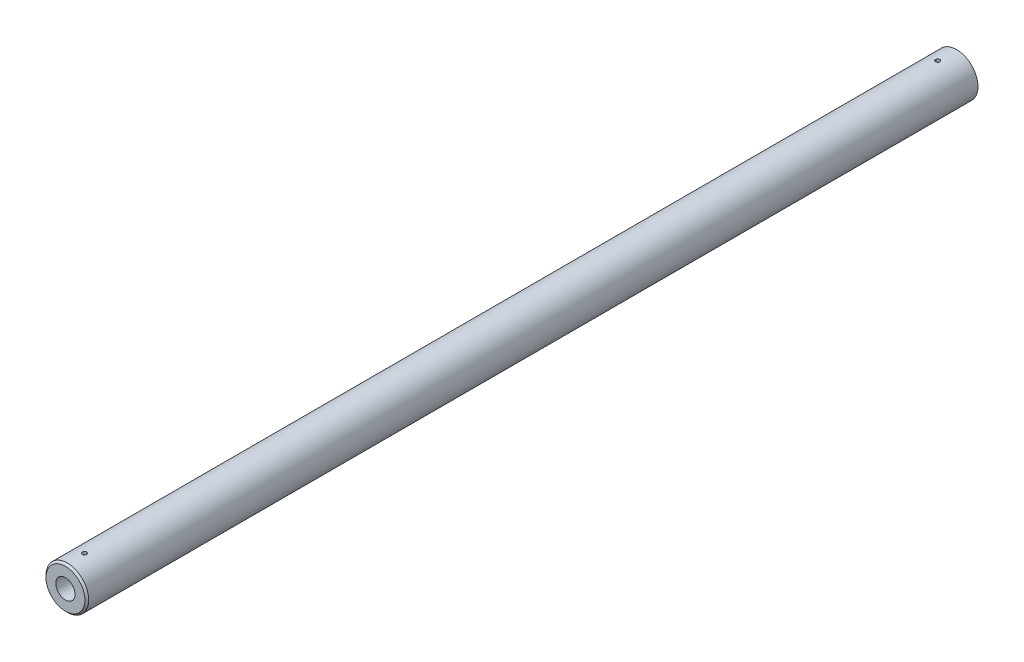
from build123d import *

# Parameters (mm, degrees)
ESQUISSE3_R      = 2.25
EXTRUSION1_DEPTH = 30


with BuildPart() as part:
    # Esquisse2 → R_volution1 (revolve)
    with BuildSketch(Plane(origin=(0, 0, 0), x_dir=(0, 0, -1), z_dir=(1, 0, 0)), mode=Mode.PRIVATE) as r_volution1_sk:
        Polygon((0, 20.5), (0, 10.16), (100, 10.16), (100, 10.5), (110, 10.5), (110.288675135, 10), (838, 10), (838.288675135, 10.5), (848.288675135, 10.5), (848.288675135, 10.16), (938, 10.16), (938, 22.5), (2, 22.5), align=None)
    revolve(r_volution1_sk.sketch.rotate(Axis((0, 0, 0), (0, 0, -1)), 90), axis=Axis((0, 0, 0), (0, 0, -1)))

    # Esquisse3 → Extrusion1 (cut, symmetric)
    with BuildSketch(Plane(origin=(0, 0, 0), x_dir=(1, 0, 0), z_dir=(0, 1, 0))):
        with Locations(Location((0, 918, 0), (0, 0, 270))):
            Circle(ESQUISSE3_R)
        with Locations(Location((0, 20, 0), (0, 0, 270))):
            Circle(ESQUISSE3_R)
    extrude(amount=EXTRUSION1_DEPTH, both=True, mode=Mode.SUBTRACT)


solid = part.part
